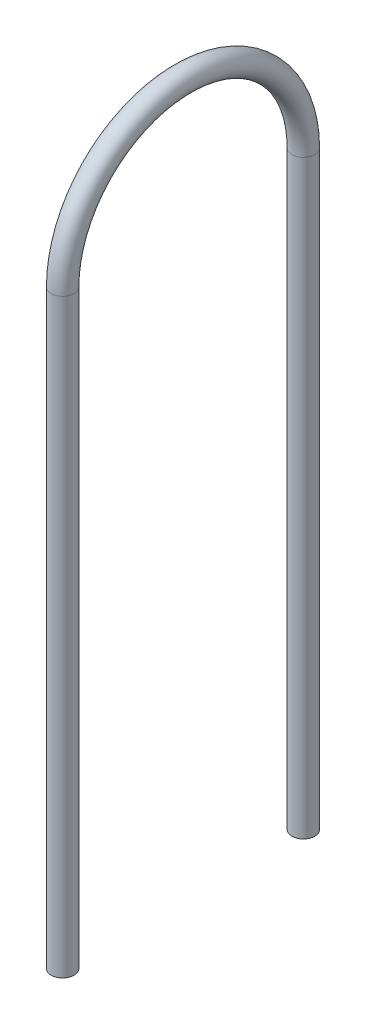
ISO-10303-21;
HEADER;
FILE_DESCRIPTION(('STEP AP214'),'2;1');
FILE_NAME('part.step','',(''),(''),'','','');
FILE_SCHEMA(('AUTOMOTIVE_DESIGN { 1 0 10303 214 1 1 1 1 }'));
ENDSEC;
DATA;
#1=APPLICATION_CONTEXT('core data for automotive mechanical design processes');
#2=APPLICATION_PROTOCOL_DEFINITION('international standard','automotive_design',2000,#1);
#3=PRODUCT_CONTEXT('',#1,'mechanical');
#4=PRODUCT('Part','Part','',(#3));
#5=PRODUCT_RELATED_PRODUCT_CATEGORY('part','',(#4));
#6=PRODUCT_DEFINITION_FORMATION('','',#4);
#7=PRODUCT_DEFINITION_CONTEXT('part definition',#1,'design');
#8=PRODUCT_DEFINITION('design','',#6,#7);
#9=PRODUCT_DEFINITION_SHAPE('','',#8);
#10=(LENGTH_UNIT() NAMED_UNIT(*) SI_UNIT(.MILLI.,.METRE.));
#11=(NAMED_UNIT(*) PLANE_ANGLE_UNIT() SI_UNIT($,.RADIAN.));
#12=(NAMED_UNIT(*) SI_UNIT($,.STERADIAN.) SOLID_ANGLE_UNIT());
#13=UNCERTAINTY_MEASURE_WITH_UNIT(LENGTH_MEASURE(1.E-05),#10,'distance_accuracy_value','');
#14=(GEOMETRIC_REPRESENTATION_CONTEXT(3) GLOBAL_UNCERTAINTY_ASSIGNED_CONTEXT((#13)) GLOBAL_UNIT_ASSIGNED_CONTEXT((#10,
#11,#12)) REPRESENTATION_CONTEXT('',''));
#15=CARTESIAN_POINT('',(0.,0.,0.));
#16=DIRECTION('',(0.,0.,1.));
#17=DIRECTION('',(1.,0.,0.));
#18=AXIS2_PLACEMENT_3D('',#15,#16,#17);
#19=CARTESIAN_POINT('',(0.,103.,-21.));
#20=DIRECTION('',(0.,-1.,0.));
#21=DIRECTION('',(0.,0.,-1.));
#22=AXIS2_PLACEMENT_3D('',#19,#20,#21);
#23=CYLINDRICAL_SURFACE('',#22,2.);
#24=CARTESIAN_POINT('',(0.,103.,-21.));
#25=DIRECTION('',(0.,-1.,0.));
#26=DIRECTION('',(0.,0.,-1.));
#27=AXIS2_PLACEMENT_3D('',#24,#25,#26);
#28=CIRCLE('',#27,2.);
#29=CARTESIAN_POINT('',(0.,103.,-23.));
#30=VERTEX_POINT('',#29);
#31=EDGE_CURVE('E36',#30,#30,#28,.T.);
#32=ORIENTED_EDGE('',*,*,#31,.T.);
#33=EDGE_LOOP('',(#32));
#34=FACE_BOUND('',#33,.T.);
#35=CARTESIAN_POINT('',(0.,0.,-21.));
#36=DIRECTION('',(0.,-1.,0.));
#37=DIRECTION('',(0.,0.,-1.));
#38=AXIS2_PLACEMENT_3D('',#35,#36,#37);
#39=CIRCLE('',#38,2.);
#40=CARTESIAN_POINT('',(0.,0.,-23.));
#41=VERTEX_POINT('',#40);
#42=EDGE_CURVE('E10',#41,#41,#39,.T.);
#43=ORIENTED_EDGE('',*,*,#42,.F.);
#44=EDGE_LOOP('',(#43));
#45=FACE_BOUND('',#44,.T.);
#46=ADVANCED_FACE('F30',(#34,#45),#23,.T.);
#47=CARTESIAN_POINT('',(0.,103.,0.));
#48=DIRECTION('',(-1.,0.,0.));
#49=DIRECTION('',(0.,0.,1.));
#50=AXIS2_PLACEMENT_3D('',#47,#48,#49);
#51=TOROIDAL_SURFACE('',#50,21.,2.);
#52=CARTESIAN_POINT('',(0.,103.,21.));
#53=DIRECTION('',(0.,1.,0.));
#54=DIRECTION('',(0.,0.,1.));
#55=AXIS2_PLACEMENT_3D('',#52,#53,#54);
#56=CIRCLE('',#55,2.);
#57=CARTESIAN_POINT('',(0.,103.,23.));
#58=VERTEX_POINT('',#57);
#59=EDGE_CURVE('E40',#58,#58,#56,.T.);
#60=CARTESIAN_POINT('',(0.,103.,0.));
#61=DIRECTION('',(-1.,0.,0.));
#62=DIRECTION('',(0.,0.,1.));
#63=AXIS2_PLACEMENT_3D('',#60,#61,#62);
#64=CIRCLE('',#63,23.);
#65=EDGE_CURVE('',#58,#30,#64,.T.);
#66=ORIENTED_EDGE('',*,*,#59,.T.);
#67=ORIENTED_EDGE('',*,*,#31,.F.);
#68=ORIENTED_EDGE('',*,*,#65,.T.);
#69=ORIENTED_EDGE('',*,*,#65,.F.);
#70=EDGE_LOOP('',(#66,#68,#67,#69));
#71=FACE_BOUND('',#70,.T.);
#72=ADVANCED_FACE('F62',(#71),#51,.T.);
#73=CARTESIAN_POINT('',(0.,103.,21.));
#74=DIRECTION('',(0.,-1.,0.));
#75=DIRECTION('',(0.,0.,-1.));
#76=AXIS2_PLACEMENT_3D('',#73,#74,#75);
#77=CYLINDRICAL_SURFACE('',#76,2.);
#78=ORIENTED_EDGE('',*,*,#59,.F.);
#79=EDGE_LOOP('',(#78));
#80=FACE_BOUND('',#79,.T.);
#81=CARTESIAN_POINT('',(0.,0.,21.));
#82=DIRECTION('',(0.,1.,0.));
#83=DIRECTION('',(0.,0.,1.));
#84=AXIS2_PLACEMENT_3D('',#81,#82,#83);
#85=CIRCLE('',#84,2.);
#86=CARTESIAN_POINT('',(0.,0.,23.));
#87=VERTEX_POINT('',#86);
#88=EDGE_CURVE('E44',#87,#87,#85,.T.);
#89=ORIENTED_EDGE('',*,*,#88,.T.);
#90=EDGE_LOOP('',(#89));
#91=FACE_BOUND('',#90,.T.);
#92=ADVANCED_FACE('F50',(#80,#91),#77,.T.);
#93=CARTESIAN_POINT('',(0.,0.,-21.));
#94=DIRECTION('',(0.,-1.,0.));
#95=DIRECTION('',(0.,0.,-1.));
#96=AXIS2_PLACEMENT_3D('',#93,#94,#95);
#97=PLANE('',#96);
#98=ORIENTED_EDGE('',*,*,#42,.T.);
#99=EDGE_LOOP('',(#98));
#100=FACE_BOUND('',#99,.T.);
#101=ADVANCED_FACE('F54',(#100),#97,.T.);
#102=CARTESIAN_POINT('',(0.,0.,21.));
#103=DIRECTION('',(0.,1.,0.));
#104=DIRECTION('',(0.,0.,1.));
#105=AXIS2_PLACEMENT_3D('',#102,#103,#104);
#106=PLANE('',#105);
#107=ORIENTED_EDGE('',*,*,#88,.F.);
#108=EDGE_LOOP('',(#107));
#109=FACE_BOUND('',#108,.T.);
#110=ADVANCED_FACE('F52',(#109),#106,.F.);
#111=CLOSED_SHELL('',(#46,#72,#92,#101,#110));
#112=MANIFOLD_SOLID_BREP('B2',#111);
#113=ADVANCED_BREP_SHAPE_REPRESENTATION('',(#18,#112),#14);
#114=SHAPE_DEFINITION_REPRESENTATION(#9,#113);
ENDSEC;
END-ISO-10303-21;
